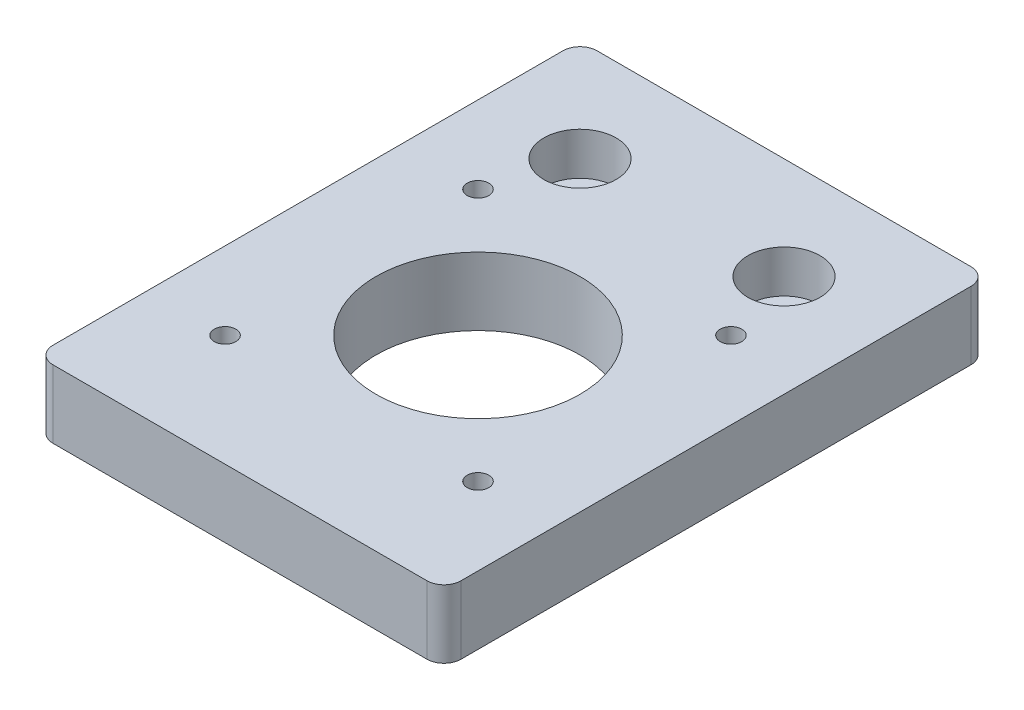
from build123d import *

# Parameters (mm, degrees)
SKETCH2_W                                         = 76.2
SKETCH2_H                                         = 101.6
EXTRUDE1_DEPTH                                    = 12.7
SKETCH3_R                                         = 19.0627
CUT_EXTRUDE1_DEPTH                                = 128.633420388
CBORE_FOR_5_16_SOCKET_HEAD_CAP_SCREW1_D           = 8.2042
CBORE_FOR_5_16_SOCKET_HEAD_CAP_SCREW1_CBORE_D     = 13.49502
CBORE_FOR_5_16_SOCKET_HEAD_CAP_SCREW1_CBORE_DEPTH = 7.9375
F_10_32_TAPPED_HOLE1_D                            = 4.0386
FILLET1_R                                         = 3.175


with BuildPart() as part:
    # Sketch2 → Extrude1 (new body)
    with BuildSketch(Plane(origin=(0, 0, 0), x_dir=(1, 0, 0), z_dir=(0, 1, 0))):
        with Locations((38.1, 50.8)):
            Rectangle(SKETCH2_W, SKETCH2_H)
    extrude(amount=EXTRUDE1_DEPTH)

    # Sketch3 → Cut-Extrude1 (cut, through all)
    with BuildSketch(Plane(origin=(0, 12.7, 0), x_dir=(-1, 0, 0), z_dir=(0, 1, 0))):
        with Locations(Location((-38.1, -44.45, 0), (0, 0, 90))):
            Circle(SKETCH3_R)
    extrude(amount=-CUT_EXTRUDE1_DEPTH, mode=Mode.SUBTRACT)

    # CBORE for 5_16 Socket Head Cap Screw1 (through all)
    with Locations(Plane(origin=(0, 12.7, 0), x_dir=(-1, 0, 0), z_dir=(0, 1, 0))):
        with Locations((-57.15, -82.55), (-19.05, -82.55)):
            CounterBoreHole(CBORE_FOR_5_16_SOCKET_HEAD_CAP_SCREW1_D / 2, CBORE_FOR_5_16_SOCKET_HEAD_CAP_SCREW1_CBORE_D / 2, CBORE_FOR_5_16_SOCKET_HEAD_CAP_SCREW1_CBORE_DEPTH)

    # 10-32 Tapped Hole1 (through all)
    with Locations(Plane(origin=(0, 12.7, 0), x_dir=(-1, 0, 0), z_dir=(0, 1, 0))):
        with Locations((-61.722, -20.828), (-14.478, -20.828), (-14.478, -68.072), (-61.722, -68.072)):
            Hole(F_10_32_TAPPED_HOLE1_D / 2)

    # Fillet1
    fillet1_edges = [part.edges().sort_by_distance(p)[0] for p in [
        (0, 6.35, -101.6),
        (76.2, 6.35, -101.6),
        (76.2, 6.35, 0),
        (0, 6.35, 0),
    ]]
    fillet(fillet1_edges, radius=FILLET1_R)


solid = part.part
